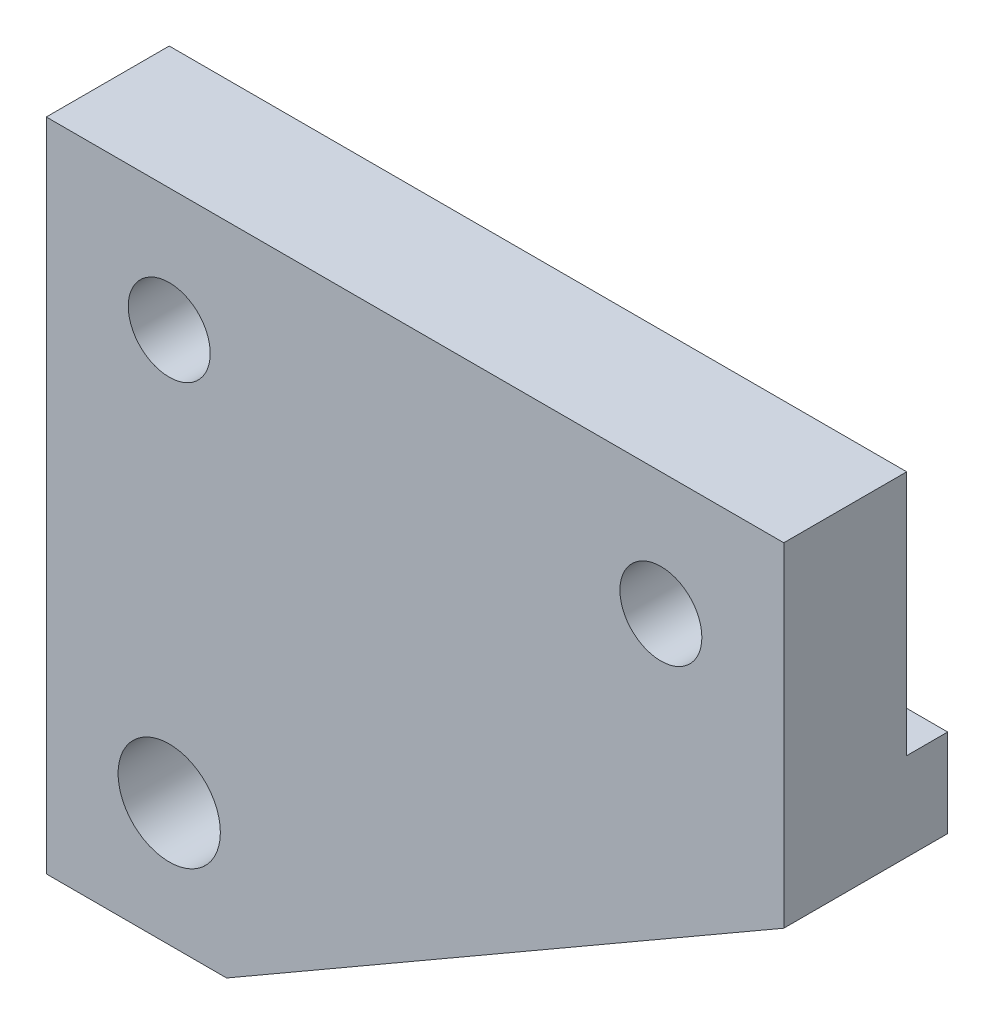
ISO-10303-21;
HEADER;
FILE_DESCRIPTION(('STEP AP214'),'2;1');
FILE_NAME('part.step','',(''),(''),'','','');
FILE_SCHEMA(('AUTOMOTIVE_DESIGN { 1 0 10303 214 1 1 1 1 }'));
ENDSEC;
DATA;
#1=APPLICATION_CONTEXT('core data for automotive mechanical design processes');
#2=APPLICATION_PROTOCOL_DEFINITION('international standard','automotive_design',2000,#1);
#3=PRODUCT_CONTEXT('',#1,'mechanical');
#4=PRODUCT('Part','Part','',(#3));
#5=PRODUCT_RELATED_PRODUCT_CATEGORY('part','',(#4));
#6=PRODUCT_DEFINITION_FORMATION('','',#4);
#7=PRODUCT_DEFINITION_CONTEXT('part definition',#1,'design');
#8=PRODUCT_DEFINITION('design','',#6,#7);
#9=PRODUCT_DEFINITION_SHAPE('','',#8);
#10=(LENGTH_UNIT() NAMED_UNIT(*) SI_UNIT(.MILLI.,.METRE.));
#11=(NAMED_UNIT(*) PLANE_ANGLE_UNIT() SI_UNIT($,.RADIAN.));
#12=(NAMED_UNIT(*) SI_UNIT($,.STERADIAN.) SOLID_ANGLE_UNIT());
#13=UNCERTAINTY_MEASURE_WITH_UNIT(LENGTH_MEASURE(1.E-05),#10,'distance_accuracy_value','');
#14=(GEOMETRIC_REPRESENTATION_CONTEXT(3) GLOBAL_UNCERTAINTY_ASSIGNED_CONTEXT((#13)) GLOBAL_UNIT_ASSIGNED_CONTEXT((#10,
#11,#12)) REPRESENTATION_CONTEXT('',''));
#15=CARTESIAN_POINT('',(0.,0.,0.));
#16=DIRECTION('',(0.,0.,1.));
#17=DIRECTION('',(1.,0.,0.));
#18=AXIS2_PLACEMENT_3D('',#15,#16,#17);
#19=CARTESIAN_POINT('',(0.,0.,0.));
#20=DIRECTION('',(0.,0.,-1.));
#21=DIRECTION('',(-1.,0.,0.));
#22=AXIS2_PLACEMENT_3D('',#19,#20,#21);
#23=PLANE('',#22);
#24=CARTESIAN_POINT('',(-19.05,-41.275,0.));
#25=DIRECTION('',(0.,0.,1.));
#26=DIRECTION('',(1.,0.,0.));
#27=AXIS2_PLACEMENT_3D('',#24,#25,#26);
#28=CIRCLE('',#27,3.96240000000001);
#29=CARTESIAN_POINT('',(-15.0876,-41.275,0.));
#30=VERTEX_POINT('',#29);
#31=EDGE_CURVE('E127',#30,#30,#28,.T.);
#32=ORIENTED_EDGE('',*,*,#31,.T.);
#33=EDGE_LOOP('',(#32));
#34=FACE_BOUND('',#33,.T.);
#35=DIRECTION('',(0.,1.,0.));
#36=VECTOR('',#35,1.);
#37=CARTESIAN_POINT('',(28.575,0.,0.));
#38=LINE('',#37,#36);
#39=CARTESIAN_POINT('',(28.575,-25.8700153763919,0.));
#40=VERTEX_POINT('',#39);
#41=CARTESIAN_POINT('',(28.575,-19.05,0.));
#42=VERTEX_POINT('',#41);
#43=EDGE_CURVE('E116',#40,#42,#38,.T.);
#44=ORIENTED_EDGE('',*,*,#43,.F.);
#45=DIRECTION('',(0.86602540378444,0.499999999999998,0.));
#46=VECTOR('',#45,1.);
#47=CARTESIAN_POINT('',(18.3457952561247,-31.7758494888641,0.));
#48=LINE('',#47,#46);
#49=CARTESIAN_POINT('',(-14.6050000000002,-50.8,0.));
#50=VERTEX_POINT('',#49);
#51=EDGE_CURVE('E55',#40,#50,#48,.F.);
#52=ORIENTED_EDGE('',*,*,#51,.T.);
#53=DIRECTION('',(1.,0.,0.));
#54=VECTOR('',#53,1.);
#55=CARTESIAN_POINT('',(28.575,-50.8,0.));
#56=LINE('',#55,#54);
#57=CARTESIAN_POINT('',(-28.575,-50.8,0.));
#58=VERTEX_POINT('',#57);
#59=EDGE_CURVE('E142',#58,#50,#56,.T.);
#60=ORIENTED_EDGE('',*,*,#59,.F.);
#61=DIRECTION('',(0.,-1.,0.));
#62=VECTOR('',#61,1.);
#63=CARTESIAN_POINT('',(-28.575,-50.8,0.));
#64=LINE('',#63,#62);
#65=CARTESIAN_POINT('',(-28.575,-19.05,0.));
#66=VERTEX_POINT('',#65);
#67=EDGE_CURVE('E150',#66,#58,#64,.T.);
#68=ORIENTED_EDGE('',*,*,#67,.F.);
#69=DIRECTION('',(1.,0.,0.));
#70=VECTOR('',#69,1.);
#71=CARTESIAN_POINT('',(-28.575,-19.05,0.));
#72=LINE('',#71,#70);
#73=EDGE_CURVE('E122',#66,#42,#72,.T.);
#74=ORIENTED_EDGE('',*,*,#73,.T.);
#75=EDGE_LOOP('',(#44,#52,#60,#68,#74));
#76=FACE_BOUND('',#75,.T.);
#77=ADVANCED_FACE('F33',(#34,#76),#23,.T.);
#78=CARTESIAN_POINT('',(28.575,0.,12.7));
#79=DIRECTION('',(-1.,0.,0.));
#80=DIRECTION('',(0.,-1.,0.));
#81=AXIS2_PLACEMENT_3D('',#78,#79,#80);
#82=PLANE('',#81);
#83=DIRECTION('',(0.,1.,0.));
#84=VECTOR('',#83,1.);
#85=CARTESIAN_POINT('',(28.575,0.,12.7));
#86=LINE('',#85,#84);
#87=CARTESIAN_POINT('',(28.575,-25.8700153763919,12.7));
#88=VERTEX_POINT('',#87);
#89=CARTESIAN_POINT('',(28.575,0.,12.7));
#90=VERTEX_POINT('',#89);
#91=EDGE_CURVE('E139',#88,#90,#86,.T.);
#92=ORIENTED_EDGE('',*,*,#91,.F.);
#93=DIRECTION('',(0.,0.,-1.));
#94=VECTOR('',#93,1.);
#95=CARTESIAN_POINT('',(28.575,-25.8700153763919,12.7));
#96=LINE('',#95,#94);
#97=EDGE_CURVE('E160',#88,#40,#96,.T.);
#98=ORIENTED_EDGE('',*,*,#97,.T.);
#99=ORIENTED_EDGE('',*,*,#43,.T.);
#100=DIRECTION('',(0.,0.,-1.));
#101=VECTOR('',#100,1.);
#102=CARTESIAN_POINT('',(28.575,-19.05,3.175));
#103=LINE('',#102,#101);
#104=CARTESIAN_POINT('',(28.575,-19.05,3.175));
#105=VERTEX_POINT('',#104);
#106=EDGE_CURVE('E96',#105,#42,#103,.T.);
#107=ORIENTED_EDGE('',*,*,#106,.F.);
#108=DIRECTION('',(0.,1.,0.));
#109=VECTOR('',#108,1.);
#110=CARTESIAN_POINT('',(28.575,0.,3.175));
#111=LINE('',#110,#109);
#112=CARTESIAN_POINT('',(28.575,0.,3.175));
#113=VERTEX_POINT('',#112);
#114=EDGE_CURVE('E102',#105,#113,#111,.T.);
#115=ORIENTED_EDGE('',*,*,#114,.T.);
#116=DIRECTION('',(0.,0.,-1.));
#117=VECTOR('',#116,1.);
#118=CARTESIAN_POINT('',(28.575,0.,12.7));
#119=LINE('',#118,#117);
#120=EDGE_CURVE('E158',#90,#113,#119,.T.);
#121=ORIENTED_EDGE('',*,*,#120,.F.);
#122=EDGE_LOOP('',(#92,#98,#99,#107,#115,#121));
#123=FACE_BOUND('',#122,.T.);
#124=ADVANCED_FACE('F114',(#123),#82,.F.);
#125=CARTESIAN_POINT('',(-28.575,0.,12.7));
#126=DIRECTION('',(0.,-1.,0.));
#127=DIRECTION('',(0.,0.,-1.));
#128=AXIS2_PLACEMENT_3D('',#125,#126,#127);
#129=PLANE('',#128);
#130=DIRECTION('',(-1.,0.,0.));
#131=VECTOR('',#130,1.);
#132=CARTESIAN_POINT('',(0.,0.,3.175));
#133=LINE('',#132,#131);
#134=CARTESIAN_POINT('',(-28.575,0.,3.175));
#135=VERTEX_POINT('',#134);
#136=EDGE_CURVE('E108',#113,#135,#133,.T.);
#137=ORIENTED_EDGE('',*,*,#136,.T.);
#138=DIRECTION('',(0.,0.,-1.));
#139=VECTOR('',#138,1.);
#140=CARTESIAN_POINT('',(-28.575,0.,12.7));
#141=LINE('',#140,#139);
#142=CARTESIAN_POINT('',(-28.575,0.,12.7));
#143=VERTEX_POINT('',#142);
#144=EDGE_CURVE('E155',#143,#135,#141,.T.);
#145=ORIENTED_EDGE('',*,*,#144,.F.);
#146=DIRECTION('',(-1.,0.,0.));
#147=VECTOR('',#146,1.);
#148=CARTESIAN_POINT('',(0.,0.,12.7));
#149=LINE('',#148,#147);
#150=EDGE_CURVE('E141',#90,#143,#149,.T.);
#151=ORIENTED_EDGE('',*,*,#150,.F.);
#152=ORIENTED_EDGE('',*,*,#120,.T.);
#153=EDGE_LOOP('',(#137,#145,#151,#152));
#154=FACE_BOUND('',#153,.T.);
#155=ADVANCED_FACE('F174',(#154),#129,.F.);
#156=CARTESIAN_POINT('',(-28.575,-50.8,12.7));
#157=DIRECTION('',(1.,0.,0.));
#158=DIRECTION('',(0.,0.,-1.));
#159=AXIS2_PLACEMENT_3D('',#156,#157,#158);
#160=PLANE('',#159);
#161=DIRECTION('',(0.,0.,-1.));
#162=VECTOR('',#161,1.);
#163=CARTESIAN_POINT('',(-28.575,-19.05,3.175));
#164=LINE('',#163,#162);
#165=CARTESIAN_POINT('',(-28.575,-19.05,3.175));
#166=VERTEX_POINT('',#165);
#167=EDGE_CURVE('E99',#166,#66,#164,.T.);
#168=ORIENTED_EDGE('',*,*,#167,.T.);
#169=ORIENTED_EDGE('',*,*,#67,.T.);
#170=DIRECTION('',(0.,0.,-1.));
#171=VECTOR('',#170,1.);
#172=CARTESIAN_POINT('',(-28.575,-50.8,12.7));
#173=LINE('',#172,#171);
#174=CARTESIAN_POINT('',(-28.575,-50.8,12.7));
#175=VERTEX_POINT('',#174);
#176=EDGE_CURVE('E148',#175,#58,#173,.T.);
#177=ORIENTED_EDGE('',*,*,#176,.F.);
#178=DIRECTION('',(0.,-1.,0.));
#179=VECTOR('',#178,1.);
#180=CARTESIAN_POINT('',(-28.575,-50.8,12.7));
#181=LINE('',#180,#179);
#182=EDGE_CURVE('E144',#143,#175,#181,.T.);
#183=ORIENTED_EDGE('',*,*,#182,.F.);
#184=ORIENTED_EDGE('',*,*,#144,.T.);
#185=DIRECTION('',(0.,-1.,0.));
#186=VECTOR('',#185,1.);
#187=CARTESIAN_POINT('',(-28.575,-19.05,3.175));
#188=LINE('',#187,#186);
#189=EDGE_CURVE('E103',#135,#166,#188,.T.);
#190=ORIENTED_EDGE('',*,*,#189,.T.);
#191=EDGE_LOOP('',(#168,#169,#177,#183,#184,#190));
#192=FACE_BOUND('',#191,.T.);
#193=ADVANCED_FACE('F170',(#192),#160,.F.);
#194=CARTESIAN_POINT('',(-19.05,-9.525,12.7));
#195=DIRECTION('',(0.,0.,-1.));
#196=DIRECTION('',(-1.,0.,0.));
#197=AXIS2_PLACEMENT_3D('',#194,#195,#196);
#198=CYLINDRICAL_SURFACE('',#197,3.175);
#199=CARTESIAN_POINT('',(-19.05,-9.525,12.7));
#200=DIRECTION('',(0.,0.,1.));
#201=DIRECTION('',(1.,0.,0.));
#202=AXIS2_PLACEMENT_3D('',#199,#200,#201);
#203=CIRCLE('',#202,3.175);
#204=CARTESIAN_POINT('',(-15.875,-9.525,12.7));
#205=VERTEX_POINT('',#204);
#206=EDGE_CURVE('E136',#205,#205,#203,.T.);
#207=ORIENTED_EDGE('',*,*,#206,.T.);
#208=EDGE_LOOP('',(#207));
#209=FACE_BOUND('',#208,.T.);
#210=CARTESIAN_POINT('',(-19.05,-9.525,3.175));
#211=DIRECTION('',(0.,0.,-1.));
#212=DIRECTION('',(-1.,0.,0.));
#213=AXIS2_PLACEMENT_3D('',#210,#211,#212);
#214=CIRCLE('',#213,3.175);
#215=CARTESIAN_POINT('',(-22.225,-9.525,3.175));
#216=VERTEX_POINT('',#215);
#217=EDGE_CURVE('E124',#216,#216,#214,.T.);
#218=ORIENTED_EDGE('',*,*,#217,.T.);
#219=EDGE_LOOP('',(#218));
#220=FACE_BOUND('',#219,.T.);
#221=ADVANCED_FACE('F201',(#209,#220),#198,.F.);
#222=CARTESIAN_POINT('',(19.05,-9.525,12.7));
#223=DIRECTION('',(0.,0.,-1.));
#224=DIRECTION('',(-1.,0.,0.));
#225=AXIS2_PLACEMENT_3D('',#222,#223,#224);
#226=CYLINDRICAL_SURFACE('',#225,3.175);
#227=CARTESIAN_POINT('',(19.05,-9.525,12.7));
#228=DIRECTION('',(0.,0.,1.));
#229=DIRECTION('',(1.,0.,0.));
#230=AXIS2_PLACEMENT_3D('',#227,#228,#229);
#231=CIRCLE('',#230,3.175);
#232=CARTESIAN_POINT('',(22.225,-9.525,12.7));
#233=VERTEX_POINT('',#232);
#234=EDGE_CURVE('E131',#233,#233,#231,.T.);
#235=ORIENTED_EDGE('',*,*,#234,.T.);
#236=EDGE_LOOP('',(#235));
#237=FACE_BOUND('',#236,.T.);
#238=CARTESIAN_POINT('',(19.05,-9.525,3.175));
#239=DIRECTION('',(0.,0.,-1.));
#240=DIRECTION('',(-1.,0.,0.));
#241=AXIS2_PLACEMENT_3D('',#238,#239,#240);
#242=CIRCLE('',#241,3.175);
#243=CARTESIAN_POINT('',(15.875,-9.525,3.175));
#244=VERTEX_POINT('',#243);
#245=EDGE_CURVE('E118',#244,#244,#242,.T.);
#246=ORIENTED_EDGE('',*,*,#245,.T.);
#247=EDGE_LOOP('',(#246));
#248=FACE_BOUND('',#247,.T.);
#249=ADVANCED_FACE('F218',(#237,#248),#226,.F.);
#250=CARTESIAN_POINT('',(0.,0.,12.7));
#251=DIRECTION('',(0.,0.,-1.));
#252=DIRECTION('',(-1.,0.,0.));
#253=AXIS2_PLACEMENT_3D('',#250,#251,#252);
#254=PLANE('',#253);
#255=ORIENTED_EDGE('',*,*,#234,.F.);
#256=EDGE_LOOP('',(#255));
#257=FACE_BOUND('',#256,.T.);
#258=DIRECTION('',(1.,0.,0.));
#259=VECTOR('',#258,1.);
#260=CARTESIAN_POINT('',(28.575,-50.8,12.7));
#261=LINE('',#260,#259);
#262=CARTESIAN_POINT('',(-14.6050000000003,-50.8,12.7));
#263=VERTEX_POINT('',#262);
#264=EDGE_CURVE('E146',#175,#263,#261,.T.);
#265=ORIENTED_EDGE('',*,*,#264,.T.);
#266=DIRECTION('',(-0.86602540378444,-0.499999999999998,0.));
#267=VECTOR('',#266,1.);
#268=CARTESIAN_POINT('',(28.575,-25.8700153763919,12.7));
#269=LINE('',#268,#267);
#270=EDGE_CURVE('E11',#263,#88,#269,.F.);
#271=ORIENTED_EDGE('',*,*,#270,.T.);
#272=ORIENTED_EDGE('',*,*,#91,.T.);
#273=ORIENTED_EDGE('',*,*,#150,.T.);
#274=ORIENTED_EDGE('',*,*,#182,.T.);
#275=EDGE_LOOP('',(#265,#271,#272,#273,#274));
#276=FACE_BOUND('',#275,.T.);
#277=ORIENTED_EDGE('',*,*,#206,.F.);
#278=EDGE_LOOP('',(#277));
#279=FACE_BOUND('',#278,.T.);
#280=CARTESIAN_POINT('',(-19.05,-41.275,12.7));
#281=DIRECTION('',(0.,0.,1.));
#282=DIRECTION('',(1.,0.,0.));
#283=AXIS2_PLACEMENT_3D('',#280,#281,#282);
#284=CIRCLE('',#283,3.96240000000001);
#285=CARTESIAN_POINT('',(-15.0876,-41.275,12.7));
#286=VERTEX_POINT('',#285);
#287=EDGE_CURVE('E128',#286,#286,#284,.T.);
#288=ORIENTED_EDGE('',*,*,#287,.F.);
#289=EDGE_LOOP('',(#288));
#290=FACE_BOUND('',#289,.T.);
#291=ADVANCED_FACE('F177',(#257,#276,#279,#290),#254,.F.);
#292=CARTESIAN_POINT('',(28.575,-50.8,12.7));
#293=DIRECTION('',(0.,1.,0.));
#294=DIRECTION('',(-1.,0.,0.));
#295=AXIS2_PLACEMENT_3D('',#292,#293,#294);
#296=PLANE('',#295);
#297=ORIENTED_EDGE('',*,*,#59,.T.);
#298=DIRECTION('',(0.,0.,1.));
#299=VECTOR('',#298,1.);
#300=CARTESIAN_POINT('',(-14.6050000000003,-50.8,12.7));
#301=LINE('',#300,#299);
#302=EDGE_CURVE('E41',#50,#263,#301,.T.);
#303=ORIENTED_EDGE('',*,*,#302,.T.);
#304=ORIENTED_EDGE('',*,*,#264,.F.);
#305=ORIENTED_EDGE('',*,*,#176,.T.);
#306=EDGE_LOOP('',(#297,#303,#304,#305));
#307=FACE_BOUND('',#306,.T.);
#308=ADVANCED_FACE('F195',(#307),#296,.F.);
#309=CARTESIAN_POINT('',(-19.05,-41.275,12.7));
#310=DIRECTION('',(0.,0.,-1.));
#311=DIRECTION('',(-1.,0.,0.));
#312=AXIS2_PLACEMENT_3D('',#309,#310,#311);
#313=CYLINDRICAL_SURFACE('',#312,3.96240000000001);
#314=ORIENTED_EDGE('',*,*,#287,.T.);
#315=EDGE_LOOP('',(#314));
#316=FACE_BOUND('',#315,.T.);
#317=ORIENTED_EDGE('',*,*,#31,.F.);
#318=EDGE_LOOP('',(#317));
#319=FACE_BOUND('',#318,.T.);
#320=ADVANCED_FACE('F198',(#316,#319),#313,.F.);
#321=CARTESIAN_POINT('',(-28.575,-19.05,3.175));
#322=DIRECTION('',(0.,1.,0.));
#323=DIRECTION('',(0.,0.,1.));
#324=AXIS2_PLACEMENT_3D('',#321,#322,#323);
#325=PLANE('',#324);
#326=ORIENTED_EDGE('',*,*,#73,.F.);
#327=ORIENTED_EDGE('',*,*,#167,.F.);
#328=DIRECTION('',(1.,0.,0.));
#329=VECTOR('',#328,1.);
#330=CARTESIAN_POINT('',(-28.575,-19.05,3.175));
#331=LINE('',#330,#329);
#332=EDGE_CURVE('E92',#166,#105,#331,.T.);
#333=ORIENTED_EDGE('',*,*,#332,.T.);
#334=ORIENTED_EDGE('',*,*,#106,.T.);
#335=EDGE_LOOP('',(#326,#327,#333,#334));
#336=FACE_BOUND('',#335,.T.);
#337=ADVANCED_FACE('F94',(#336),#325,.T.);
#338=CARTESIAN_POINT('',(0.,0.,3.175));
#339=DIRECTION('',(0.,0.,-1.));
#340=DIRECTION('',(-1.,0.,0.));
#341=AXIS2_PLACEMENT_3D('',#338,#339,#340);
#342=PLANE('',#341);
#343=ORIENTED_EDGE('',*,*,#217,.F.);
#344=EDGE_LOOP('',(#343));
#345=FACE_BOUND('',#344,.T.);
#346=ORIENTED_EDGE('',*,*,#245,.F.);
#347=EDGE_LOOP('',(#346));
#348=FACE_BOUND('',#347,.T.);
#349=ORIENTED_EDGE('',*,*,#189,.F.);
#350=ORIENTED_EDGE('',*,*,#136,.F.);
#351=ORIENTED_EDGE('',*,*,#114,.F.);
#352=ORIENTED_EDGE('',*,*,#332,.F.);
#353=EDGE_LOOP('',(#349,#350,#351,#352));
#354=FACE_BOUND('',#353,.T.);
#355=ADVANCED_FACE('F106',(#345,#348,#354),#342,.T.);
#356=CARTESIAN_POINT('',(28.575,-25.8700153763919,12.7));
#357=DIRECTION('',(-0.499999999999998,0.86602540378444,0.));
#358=DIRECTION('',(0.,0.,-1.));
#359=AXIS2_PLACEMENT_3D('',#356,#357,#358);
#360=PLANE('',#359);
#361=ORIENTED_EDGE('',*,*,#270,.F.);
#362=ORIENTED_EDGE('',*,*,#302,.F.);
#363=ORIENTED_EDGE('',*,*,#51,.F.);
#364=ORIENTED_EDGE('',*,*,#97,.F.);
#365=EDGE_LOOP('',(#361,#362,#363,#364));
#366=FACE_BOUND('',#365,.T.);
#367=ADVANCED_FACE('F35',(#366),#360,.F.);
#368=CLOSED_SHELL('',(#77,#124,#155,#193,#221,#249,#291,#308,#320,#337,#355,#367));
#369=MANIFOLD_SOLID_BREP('B2',#368);
#370=ADVANCED_BREP_SHAPE_REPRESENTATION('',(#18,#369),#14);
#371=SHAPE_DEFINITION_REPRESENTATION(#9,#370);
ENDSEC;
END-ISO-10303-21;
